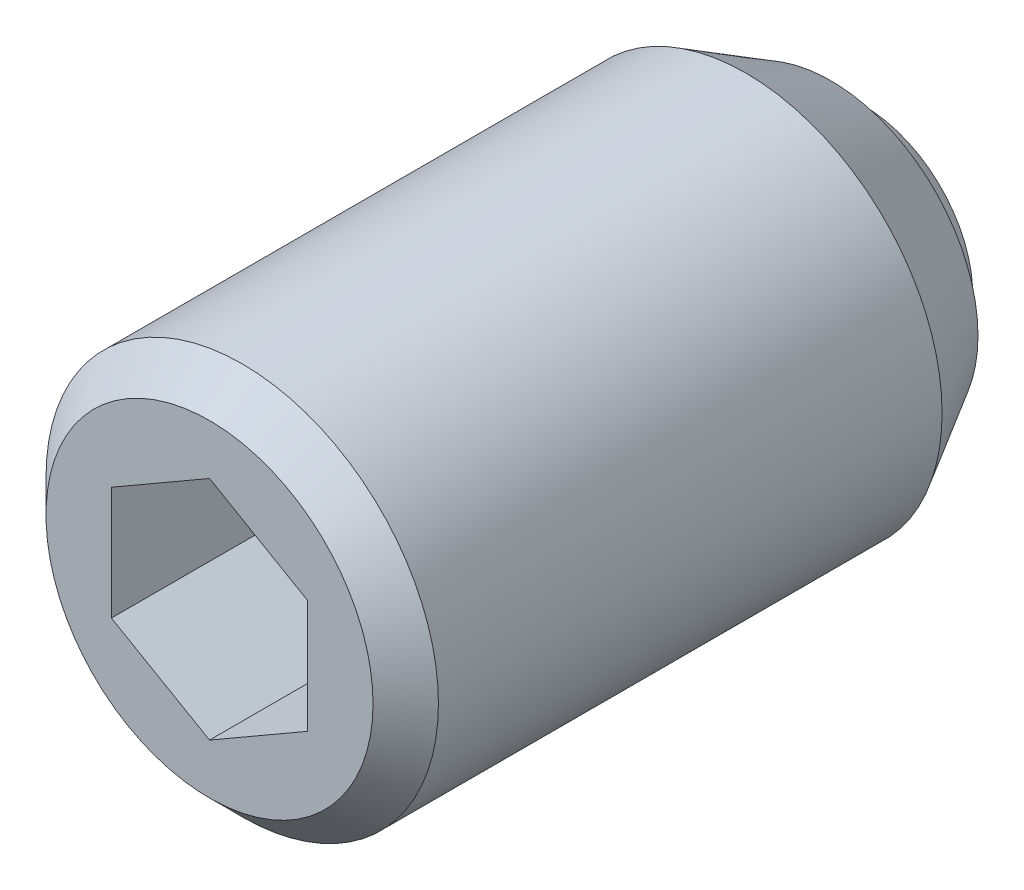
ISO-10303-21;
HEADER;
FILE_DESCRIPTION(('STEP AP214'),'2;1');
FILE_NAME('part.step','',(''),(''),'','','');
FILE_SCHEMA(('AUTOMOTIVE_DESIGN { 1 0 10303 214 1 1 1 1 }'));
ENDSEC;
DATA;
#1=APPLICATION_CONTEXT('core data for automotive mechanical design processes');
#2=APPLICATION_PROTOCOL_DEFINITION('international standard','automotive_design',2000,#1);
#3=PRODUCT_CONTEXT('',#1,'mechanical');
#4=PRODUCT('Part','Part','',(#3));
#5=PRODUCT_RELATED_PRODUCT_CATEGORY('part','',(#4));
#6=PRODUCT_DEFINITION_FORMATION('','',#4);
#7=PRODUCT_DEFINITION_CONTEXT('part definition',#1,'design');
#8=PRODUCT_DEFINITION('design','',#6,#7);
#9=PRODUCT_DEFINITION_SHAPE('','',#8);
#10=(LENGTH_UNIT() NAMED_UNIT(*) SI_UNIT(.MILLI.,.METRE.));
#11=(NAMED_UNIT(*) PLANE_ANGLE_UNIT() SI_UNIT($,.RADIAN.));
#12=(NAMED_UNIT(*) SI_UNIT($,.STERADIAN.) SOLID_ANGLE_UNIT());
#13=UNCERTAINTY_MEASURE_WITH_UNIT(LENGTH_MEASURE(1.E-05),#10,'distance_accuracy_value','');
#14=(GEOMETRIC_REPRESENTATION_CONTEXT(3) GLOBAL_UNCERTAINTY_ASSIGNED_CONTEXT((#13)) GLOBAL_UNIT_ASSIGNED_CONTEXT((#10,
#11,#12)) REPRESENTATION_CONTEXT('',''));
#15=CARTESIAN_POINT('',(0.,0.,0.));
#16=DIRECTION('',(0.,0.,1.));
#17=DIRECTION('',(1.,0.,0.));
#18=AXIS2_PLACEMENT_3D('',#15,#16,#17);
#19=CARTESIAN_POINT('',(1.5,0.866025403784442,7.5));
#20=DIRECTION('',(0.5,0.86602540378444,0.));
#21=DIRECTION('',(0.86602540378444,-0.5,0.));
#22=AXIS2_PLACEMENT_3D('',#19,#20,#21);
#23=PLANE('',#22);
#24=DIRECTION('',(0.,0.,1.));
#25=VECTOR('',#24,1.);
#26=CARTESIAN_POINT('',(1.5,0.866025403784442,7.5));
#27=LINE('',#26,#25);
#28=CARTESIAN_POINT('',(1.5,0.866025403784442,7.));
#29=VERTEX_POINT('',#28);
#30=CARTESIAN_POINT('',(1.5,0.866025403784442,10.));
#31=VERTEX_POINT('',#30);
#32=EDGE_CURVE('E68',#29,#31,#27,.T.);
#33=ORIENTED_EDGE('',*,*,#32,.T.);
#34=DIRECTION('',(-0.86602540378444,0.5,0.));
#35=VECTOR('',#34,1.);
#36=CARTESIAN_POINT('',(1.5,0.866025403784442,10.));
#37=LINE('',#36,#35);
#38=CARTESIAN_POINT('',(0.,1.73205080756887,10.));
#39=VERTEX_POINT('',#38);
#40=EDGE_CURVE('E29',#31,#39,#37,.T.);
#41=ORIENTED_EDGE('',*,*,#40,.T.);
#42=DIRECTION('',(0.,0.,1.));
#43=VECTOR('',#42,1.);
#44=CARTESIAN_POINT('',(0.,1.73205080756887,7.5));
#45=LINE('',#44,#43);
#46=CARTESIAN_POINT('',(0.,1.73205080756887,7.));
#47=VERTEX_POINT('',#46);
#48=EDGE_CURVE('E80',#47,#39,#45,.T.);
#49=ORIENTED_EDGE('',*,*,#48,.F.);
#50=DIRECTION('',(-0.86602540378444,0.5,0.));
#51=VECTOR('',#50,1.);
#52=CARTESIAN_POINT('',(1.5,0.866025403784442,7.));
#53=LINE('',#52,#51);
#54=EDGE_CURVE('E79',#29,#47,#53,.T.);
#55=ORIENTED_EDGE('',*,*,#54,.F.);
#56=EDGE_LOOP('',(#33,#41,#49,#55));
#57=FACE_BOUND('',#56,.T.);
#58=ADVANCED_FACE('F14',(#57),#23,.F.);
#59=CARTESIAN_POINT('',(1.5,-0.866025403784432,7.5));
#60=DIRECTION('',(1.,0.,0.));
#61=DIRECTION('',(0.,-1.,0.));
#62=AXIS2_PLACEMENT_3D('',#59,#60,#61);
#63=PLANE('',#62);
#64=DIRECTION('',(0.,0.,1.));
#65=VECTOR('',#64,1.);
#66=CARTESIAN_POINT('',(1.5,-0.866025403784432,7.5));
#67=LINE('',#66,#65);
#68=CARTESIAN_POINT('',(1.5,-0.866025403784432,7.));
#69=VERTEX_POINT('',#68);
#70=CARTESIAN_POINT('',(1.5,-0.866025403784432,10.));
#71=VERTEX_POINT('',#70);
#72=EDGE_CURVE('E76',#69,#71,#67,.T.);
#73=ORIENTED_EDGE('',*,*,#72,.T.);
#74=DIRECTION('',(0.,1.,0.));
#75=VECTOR('',#74,1.);
#76=CARTESIAN_POINT('',(1.5,-0.866025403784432,10.));
#77=LINE('',#76,#75);
#78=EDGE_CURVE('E75',#71,#31,#77,.T.);
#79=ORIENTED_EDGE('',*,*,#78,.T.);
#80=ORIENTED_EDGE('',*,*,#32,.F.);
#81=DIRECTION('',(0.,1.,0.));
#82=VECTOR('',#81,1.);
#83=CARTESIAN_POINT('',(1.5,-0.866025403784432,7.));
#84=LINE('',#83,#82);
#85=EDGE_CURVE('E72',#69,#29,#84,.T.);
#86=ORIENTED_EDGE('',*,*,#85,.F.);
#87=EDGE_LOOP('',(#73,#79,#80,#86));
#88=FACE_BOUND('',#87,.T.);
#89=ADVANCED_FACE('F70',(#88),#63,.F.);
#90=CARTESIAN_POINT('',(1.5,-0.866025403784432,7.5));
#91=DIRECTION('',(-0.5,0.866025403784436,0.));
#92=DIRECTION('',(0.866025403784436,0.5,0.));
#93=AXIS2_PLACEMENT_3D('',#90,#91,#92);
#94=PLANE('',#93);
#95=DIRECTION('',(0.,0.,1.));
#96=VECTOR('',#95,1.);
#97=CARTESIAN_POINT('',(0.,-1.73205080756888,7.5));
#98=LINE('',#97,#96);
#99=CARTESIAN_POINT('',(0.,-1.73205080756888,7.));
#100=VERTEX_POINT('',#99);
#101=CARTESIAN_POINT('',(0.,-1.73205080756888,10.));
#102=VERTEX_POINT('',#101);
#103=EDGE_CURVE('E122',#100,#102,#98,.T.);
#104=ORIENTED_EDGE('',*,*,#103,.T.);
#105=DIRECTION('',(-0.866025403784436,-0.5,0.));
#106=VECTOR('',#105,1.);
#107=CARTESIAN_POINT('',(1.5,-0.866025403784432,10.));
#108=LINE('',#107,#106);
#109=EDGE_CURVE('E113',#71,#102,#108,.T.);
#110=ORIENTED_EDGE('',*,*,#109,.F.);
#111=ORIENTED_EDGE('',*,*,#72,.F.);
#112=DIRECTION('',(0.866025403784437,0.5,0.));
#113=VECTOR('',#112,1.);
#114=CARTESIAN_POINT('',(0.,-1.73205080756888,7.));
#115=LINE('',#114,#113);
#116=EDGE_CURVE('E89',#100,#69,#115,.T.);
#117=ORIENTED_EDGE('',*,*,#116,.F.);
#118=EDGE_LOOP('',(#104,#110,#111,#117));
#119=FACE_BOUND('',#118,.T.);
#120=ADVANCED_FACE('F147',(#119),#94,.T.);
#121=CARTESIAN_POINT('',(-1.5,-0.866025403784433,7.5));
#122=DIRECTION('',(-0.5,-0.866025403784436,0.));
#123=DIRECTION('',(-0.866025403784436,0.5,0.));
#124=AXIS2_PLACEMENT_3D('',#121,#122,#123);
#125=PLANE('',#124);
#126=DIRECTION('',(0.,0.,1.));
#127=VECTOR('',#126,1.);
#128=CARTESIAN_POINT('',(-1.5,-0.866025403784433,7.5));
#129=LINE('',#128,#127);
#130=CARTESIAN_POINT('',(-1.5,-0.866025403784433,7.));
#131=VERTEX_POINT('',#130);
#132=CARTESIAN_POINT('',(-1.5,-0.866025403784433,10.));
#133=VERTEX_POINT('',#132);
#134=EDGE_CURVE('E120',#131,#133,#129,.T.);
#135=ORIENTED_EDGE('',*,*,#134,.T.);
#136=DIRECTION('',(0.866025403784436,-0.5,0.));
#137=VECTOR('',#136,1.);
#138=CARTESIAN_POINT('',(-1.5,-0.866025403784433,10.));
#139=LINE('',#138,#137);
#140=EDGE_CURVE('E111',#133,#102,#139,.T.);
#141=ORIENTED_EDGE('',*,*,#140,.T.);
#142=ORIENTED_EDGE('',*,*,#103,.F.);
#143=DIRECTION('',(0.866025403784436,-0.5,0.));
#144=VECTOR('',#143,1.);
#145=CARTESIAN_POINT('',(-1.5,-0.866025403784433,7.));
#146=LINE('',#145,#144);
#147=EDGE_CURVE('E101',#131,#100,#146,.T.);
#148=ORIENTED_EDGE('',*,*,#147,.F.);
#149=EDGE_LOOP('',(#135,#141,#142,#148));
#150=FACE_BOUND('',#149,.T.);
#151=ADVANCED_FACE('F157',(#150),#125,.F.);
#152=CARTESIAN_POINT('',(-1.5,-0.866025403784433,7.5));
#153=DIRECTION('',(1.,0.,0.));
#154=DIRECTION('',(0.,-1.,0.));
#155=AXIS2_PLACEMENT_3D('',#152,#153,#154);
#156=PLANE('',#155);
#157=DIRECTION('',(0.,0.,1.));
#158=VECTOR('',#157,1.);
#159=CARTESIAN_POINT('',(-1.5,0.866025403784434,7.5));
#160=LINE('',#159,#158);
#161=CARTESIAN_POINT('',(-1.5,0.866025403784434,7.));
#162=VERTEX_POINT('',#161);
#163=CARTESIAN_POINT('',(-1.5,0.866025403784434,10.));
#164=VERTEX_POINT('',#163);
#165=EDGE_CURVE('E37',#162,#164,#160,.T.);
#166=ORIENTED_EDGE('',*,*,#165,.T.);
#167=DIRECTION('',(0.,1.,0.));
#168=VECTOR('',#167,1.);
#169=CARTESIAN_POINT('',(-1.5,-0.866025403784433,10.));
#170=LINE('',#169,#168);
#171=EDGE_CURVE('E108',#133,#164,#170,.T.);
#172=ORIENTED_EDGE('',*,*,#171,.F.);
#173=ORIENTED_EDGE('',*,*,#134,.F.);
#174=DIRECTION('',(0.,-1.,0.));
#175=VECTOR('',#174,1.);
#176=CARTESIAN_POINT('',(-1.5,0.866025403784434,7.));
#177=LINE('',#176,#175);
#178=EDGE_CURVE('E98',#162,#131,#177,.T.);
#179=ORIENTED_EDGE('',*,*,#178,.F.);
#180=EDGE_LOOP('',(#166,#172,#173,#179));
#181=FACE_BOUND('',#180,.T.);
#182=ADVANCED_FACE('F153',(#181),#156,.T.);
#183=CARTESIAN_POINT('',(-1.5,0.866025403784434,7.5));
#184=DIRECTION('',(0.5,-0.866025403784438,0.));
#185=DIRECTION('',(-0.866025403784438,-0.5,0.));
#186=AXIS2_PLACEMENT_3D('',#183,#184,#185);
#187=PLANE('',#186);
#188=ORIENTED_EDGE('',*,*,#165,.F.);
#189=DIRECTION('',(-0.866025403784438,-0.5,0.));
#190=VECTOR('',#189,1.);
#191=CARTESIAN_POINT('',(0.,1.73205080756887,7.));
#192=LINE('',#191,#190);
#193=EDGE_CURVE('E84',#47,#162,#192,.T.);
#194=ORIENTED_EDGE('',*,*,#193,.F.);
#195=ORIENTED_EDGE('',*,*,#48,.T.);
#196=DIRECTION('',(0.866025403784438,0.5,0.));
#197=VECTOR('',#196,1.);
#198=CARTESIAN_POINT('',(-1.5,0.866025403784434,10.));
#199=LINE('',#198,#197);
#200=EDGE_CURVE('E105',#164,#39,#199,.T.);
#201=ORIENTED_EDGE('',*,*,#200,.F.);
#202=EDGE_LOOP('',(#188,#194,#195,#201));
#203=FACE_BOUND('',#202,.T.);
#204=ADVANCED_FACE('F150',(#203),#187,.T.);
#205=CARTESIAN_POINT('',(0.,0.,9.75));
#206=DIRECTION('',(0.,0.,-1.));
#207=DIRECTION('',(1.,0.,0.));
#208=AXIS2_PLACEMENT_3D('',#205,#206,#207);
#209=CYLINDRICAL_SURFACE('',#208,3.);
#210=CARTESIAN_POINT('',(0.,0.,9.5));
#211=DIRECTION('',(0.,0.,-1.));
#212=DIRECTION('',(1.,0.,0.));
#213=AXIS2_PLACEMENT_3D('',#210,#211,#212);
#214=CIRCLE('',#213,3.);
#215=CARTESIAN_POINT('',(3.,0.,9.5));
#216=VERTEX_POINT('',#215);
#217=EDGE_CURVE('E9',#216,#216,#214,.T.);
#218=ORIENTED_EDGE('',*,*,#217,.T.);
#219=EDGE_LOOP('',(#218));
#220=FACE_BOUND('',#219,.T.);
#221=CARTESIAN_POINT('',(0.,0.,1.79903810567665));
#222=DIRECTION('',(0.,0.,-1.));
#223=DIRECTION('',(-1.,0.,0.));
#224=AXIS2_PLACEMENT_3D('',#221,#222,#223);
#225=CIRCLE('',#224,3.);
#226=CARTESIAN_POINT('',(-3.,0.,1.79903810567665));
#227=VERTEX_POINT('',#226);
#228=EDGE_CURVE('E260',#227,#227,#225,.T.);
#229=ORIENTED_EDGE('',*,*,#228,.F.);
#230=EDGE_LOOP('',(#229));
#231=FACE_BOUND('',#230,.T.);
#232=ADVANCED_FACE('F16',(#220,#231),#209,.T.);
#233=CARTESIAN_POINT('',(0.,0.,9.5));
#234=DIRECTION('',(0.,0.,-1.));
#235=DIRECTION('',(1.,0.,0.));
#236=AXIS2_PLACEMENT_3D('',#233,#234,#235);
#237=CONICAL_SURFACE('',#236,3.,0.785398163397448);
#238=CARTESIAN_POINT('',(0.,0.,10.));
#239=DIRECTION('',(0.,0.,-1.));
#240=DIRECTION('',(1.,0.,0.));
#241=AXIS2_PLACEMENT_3D('',#238,#239,#240);
#242=CIRCLE('',#241,2.5);
#243=CARTESIAN_POINT('',(2.5,0.,10.));
#244=VERTEX_POINT('',#243);
#245=EDGE_CURVE('E22',#244,#244,#242,.T.);
#246=ORIENTED_EDGE('',*,*,#245,.T.);
#247=EDGE_LOOP('',(#246));
#248=FACE_BOUND('',#247,.T.);
#249=ORIENTED_EDGE('',*,*,#217,.F.);
#250=EDGE_LOOP('',(#249));
#251=FACE_BOUND('',#250,.T.);
#252=ADVANCED_FACE('F127',(#248,#251),#237,.T.);
#253=CARTESIAN_POINT('',(0.,0.,10.));
#254=DIRECTION('',(0.,0.,-1.));
#255=DIRECTION('',(1.,0.,0.));
#256=AXIS2_PLACEMENT_3D('',#253,#254,#255);
#257=PLANE('',#256);
#258=ORIENTED_EDGE('',*,*,#200,.T.);
#259=ORIENTED_EDGE('',*,*,#40,.F.);
#260=ORIENTED_EDGE('',*,*,#78,.F.);
#261=ORIENTED_EDGE('',*,*,#109,.T.);
#262=ORIENTED_EDGE('',*,*,#140,.F.);
#263=ORIENTED_EDGE('',*,*,#171,.T.);
#264=EDGE_LOOP('',(#258,#259,#260,#261,#262,#263));
#265=FACE_BOUND('',#264,.T.);
#266=ORIENTED_EDGE('',*,*,#245,.F.);
#267=EDGE_LOOP('',(#266));
#268=FACE_BOUND('',#267,.T.);
#269=ADVANCED_FACE('F130',(#265,#268),#257,.F.);
#270=CARTESIAN_POINT('',(1.5,0.866025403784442,7.));
#271=DIRECTION('',(0.,0.,1.));
#272=DIRECTION('',(1.,0.,0.));
#273=AXIS2_PLACEMENT_3D('',#270,#271,#272);
#274=PLANE('',#273);
#275=ORIENTED_EDGE('',*,*,#85,.T.);
#276=ORIENTED_EDGE('',*,*,#54,.T.);
#277=ORIENTED_EDGE('',*,*,#193,.T.);
#278=ORIENTED_EDGE('',*,*,#178,.T.);
#279=ORIENTED_EDGE('',*,*,#147,.T.);
#280=ORIENTED_EDGE('',*,*,#116,.T.);
#281=EDGE_LOOP('',(#275,#276,#277,#278,#279,#280));
#282=FACE_BOUND('',#281,.T.);
#283=ADVANCED_FACE('F86',(#282),#274,.T.);
#284=CARTESIAN_POINT('',(0.,0.,0.));
#285=DIRECTION('',(0.,0.,-1.));
#286=DIRECTION('',(-1.,0.,0.));
#287=AXIS2_PLACEMENT_3D('',#284,#285,#286);
#288=PLANE('',#287);
#289=CARTESIAN_POINT('',(0.,0.,0.));
#290=DIRECTION('',(0.,0.,-1.));
#291=DIRECTION('',(-1.,0.,0.));
#292=AXIS2_PLACEMENT_3D('',#289,#290,#291);
#293=CIRCLE('',#292,1.670329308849);
#294=CARTESIAN_POINT('',(-1.67032930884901,0.,0.));
#295=VERTEX_POINT('',#294);
#296=EDGE_CURVE('E90',#295,#295,#293,.T.);
#297=ORIENTED_EDGE('',*,*,#296,.T.);
#298=EDGE_LOOP('',(#297));
#299=FACE_BOUND('',#298,.T.);
#300=ADVANCED_FACE('F139',(#299),#288,.T.);
#301=CARTESIAN_POINT('',(0.,0.,1.1));
#302=DIRECTION('',(0.,0.,-1.));
#303=DIRECTION('',(-1.,0.,0.));
#304=AXIS2_PLACEMENT_3D('',#301,#302,#303);
#305=SPHERICAL_SURFACE('',#304,2.);
#306=CARTESIAN_POINT('',(0.,0.,0.5));
#307=DIRECTION('',(0.,0.,-1.));
#308=DIRECTION('',(-1.,0.,0.));
#309=AXIS2_PLACEMENT_3D('',#306,#307,#308);
#310=CIRCLE('',#309,1.90787840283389);
#311=CARTESIAN_POINT('',(-1.90787840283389,0.,0.5));
#312=VERTEX_POINT('',#311);
#313=EDGE_CURVE('E93',#312,#312,#310,.T.);
#314=CARTESIAN_POINT('',(-1.90787840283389,0.,0.5));
#315=CARTESIAN_POINT('',(-1.90614295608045,0.,0.494481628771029));
#316=CARTESIAN_POINT('',(-1.90438356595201,0.,0.488970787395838));
#317=CARTESIAN_POINT('',(-1.90081703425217,0.,0.477964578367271));
#318=CARTESIAN_POINT('',(-1.89900989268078,0.,0.472469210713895));
#319=CARTESIAN_POINT('',(-1.8953479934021,0.,0.46149436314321));
#320=CARTESIAN_POINT('',(-1.89349323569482,0.,0.456014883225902));
#321=CARTESIAN_POINT('',(-1.88973624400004,0.,0.445072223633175));
#322=CARTESIAN_POINT('',(-1.88783401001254,0.,0.439609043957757));
#323=CARTESIAN_POINT('',(-1.8839822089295,0.,0.428699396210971));
#324=CARTESIAN_POINT('',(-1.88203264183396,0.,0.423252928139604));
#325=CARTESIAN_POINT('',(-1.87808632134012,0.,0.412377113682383));
#326=CARTESIAN_POINT('',(-1.87608956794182,0.,0.40694776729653));
#327=CARTESIAN_POINT('',(-1.87204902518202,0.,0.396106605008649));
#328=CARTESIAN_POINT('',(-1.87000523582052,0.,0.39069478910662));
#329=CARTESIAN_POINT('',(-1.86587077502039,0.,0.379889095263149));
#330=CARTESIAN_POINT('',(-1.86378010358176,0.,0.374495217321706));
#331=CARTESIAN_POINT('',(-1.85955203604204,0.,0.363725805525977));
#332=CARTESIAN_POINT('',(-1.85741463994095,0.,0.358350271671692));
#333=CARTESIAN_POINT('',(-1.85309328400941,0.,0.347617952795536));
#334=CARTESIAN_POINT('',(-1.85090932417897,0.,0.342261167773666));
#335=CARTESIAN_POINT('',(-1.84649500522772,0.,0.331566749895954));
#336=CARTESIAN_POINT('',(-1.84426464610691,0.,0.326229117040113));
#337=CARTESIAN_POINT('',(-1.83975769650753,0.,0.315573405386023));
#338=CARTESIAN_POINT('',(-1.83748110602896,0.,0.310255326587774));
#339=CARTESIAN_POINT('',(-1.83288186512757,0.,0.299639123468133));
#340=CARTESIAN_POINT('',(-1.83055921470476,0.,0.29434099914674));
#341=CARTESIAN_POINT('',(-1.82586802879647,0.,0.283765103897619));
#342=CARTESIAN_POINT('',(-1.823499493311,0.,0.278487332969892));
#343=CARTESIAN_POINT('',(-1.81871671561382,0.,0.267952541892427));
#344=CARTESIAN_POINT('',(-1.81630247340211,0.,0.26269552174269));
#345=CARTESIAN_POINT('',(-1.81142846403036,0.,0.252202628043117));
#346=CARTESIAN_POINT('',(-1.80896869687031,0.,0.246966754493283));
#347=CARTESIAN_POINT('',(-1.80400382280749,0.,0.236516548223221));
#348=CARTESIAN_POINT('',(-1.80149871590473,0.,0.231302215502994));
#349=CARTESIAN_POINT('',(-1.79644335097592,0.,0.220895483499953));
#350=CARTESIAN_POINT('',(-1.79389309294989,0.,0.215703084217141));
#351=CARTESIAN_POINT('',(-1.78874761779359,0.,0.205340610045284));
#352=CARTESIAN_POINT('',(-1.78615240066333,0.,0.200170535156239));
#353=CARTESIAN_POINT('',(-1.78091720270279,0.,0.189853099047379));
#354=CARTESIAN_POINT('',(-1.77827722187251,0.,0.184705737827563));
#355=CARTESIAN_POINT('',(-1.77295269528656,0.,0.174434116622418));
#356=CARTESIAN_POINT('',(-1.77026814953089,0.,0.169309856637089));
#357=CARTESIAN_POINT('',(-1.76485469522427,0.,0.159084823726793));
#358=CARTESIAN_POINT('',(-1.76212578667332,0.,0.153984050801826));
#359=CARTESIAN_POINT('',(-1.7566238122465,0.,0.143806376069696));
#360=CARTESIAN_POINT('',(-1.75385074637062,0.,0.138729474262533));
#361=CARTESIAN_POINT('',(-1.7482606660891,0.,0.128599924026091));
#362=CARTESIAN_POINT('',(-1.74544365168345,0.,0.123547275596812));
#363=CARTESIAN_POINT('',(-1.73976588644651,0.,0.113466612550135));
#364=CARTESIAN_POINT('',(-1.73690513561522,0.,0.108438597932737));
#365=CARTESIAN_POINT('',(-1.73114011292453,0.,0.0984075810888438));
#366=CARTESIAN_POINT('',(-1.72823584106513,0.,0.0934045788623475));
#367=CARTESIAN_POINT('',(-1.72238399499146,0.,0.0834239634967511));
#368=CARTESIAN_POINT('',(-1.71943642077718,0.,0.078446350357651));
#369=CARTESIAN_POINT('',(-1.71349819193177,0.,0.0685168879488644));
#370=CARTESIAN_POINT('',(-1.71050753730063,0.,0.0635650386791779));
#371=CARTESIAN_POINT('',(-1.70448337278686,0.,0.0536874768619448));
#372=CARTESIAN_POINT('',(-1.70144986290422,0.,0.0487617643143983));
#373=CARTESIAN_POINT('',(-1.6953402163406,0.,0.0389368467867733));
#374=CARTESIAN_POINT('',(-1.69226407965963,0.,0.034037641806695));
#375=CARTESIAN_POINT('',(-1.68606941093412,0.,0.0242661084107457));
#376=CARTESIAN_POINT('',(-1.68295087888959,0.,0.0193937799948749));
#377=CARTESIAN_POINT('',(-1.67667165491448,0.,0.00967636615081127));
#378=CARTESIAN_POINT('',(-1.67351096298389,0.,0.00483128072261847));
#379=CARTESIAN_POINT('',(-1.67032930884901,0.,0.));
#380=B_SPLINE_CURVE_WITH_KNOTS('',3,(#314,#315,#316,#317,#318,#319,#320,#321,#322,#323,#324,
#325,#326,#327,#328,#329,#330,#331,#332,#333,#334,#335,#336,#337,#338,#339,#340,#341,#342,#343,
#344,#345,#346,#347,#348,#349,#350,#351,#352,#353,#354,#355,#356,#357,#358,#359,#360,#361,#362,
#363,#364,#365,#366,#367,#368,#369,#370,#371,#372,#373,#374,#375,#376,#377,#378,#379),
.UNSPECIFIED.,.F.,.F.,(4,2,2,2,2,2,2,2,2,2,2,2,2,2,2,2,2,2,2,2,2,2,2,2,2,2,2,2,2,2,2,2,4),(0.,
0.0173544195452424,0.0347088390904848,0.0520632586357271,0.0694176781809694,0.0867720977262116,
0.104126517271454,0.121480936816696,0.138835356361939,0.156189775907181,0.173544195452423,
0.190898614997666,0.208253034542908,0.22560745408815,0.242961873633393,0.260316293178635,
0.277670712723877,0.295025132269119,0.312379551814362,0.329733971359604,0.347088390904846,
0.364442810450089,0.381797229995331,0.399151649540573,0.416506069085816,0.433860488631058,
0.4512149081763,0.468569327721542,0.485923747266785,0.503278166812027,0.52063258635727,
0.537987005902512,0.555341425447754),.UNSPECIFIED.);
#381=EDGE_CURVE('BSEAM223',#312,#295,#380,.T.);
#382=ORIENTED_EDGE('',*,*,#313,.T.);
#383=ORIENTED_EDGE('',*,*,#296,.F.);
#384=ORIENTED_EDGE('',*,*,#381,.T.);
#385=ORIENTED_EDGE('',*,*,#381,.F.);
#386=EDGE_LOOP('',(#382,#384,#383,#385));
#387=FACE_BOUND('',#386,.T.);
#388=ADVANCED_FACE('F223',(#387),#305,.T.);
#389=CARTESIAN_POINT('',(-1.90787840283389,0.,0.5));
#390=DIRECTION('',(0.,0.,-1.));
#391=DIRECTION('',(-1.,0.,0.));
#392=AXIS2_PLACEMENT_3D('',#389,#390,#391);
#393=PLANE('',#392);
#394=CARTESIAN_POINT('',(0.,0.,0.5));
#395=DIRECTION('',(0.,0.,-1.));
#396=DIRECTION('',(-1.,0.,0.));
#397=AXIS2_PLACEMENT_3D('',#394,#395,#396);
#398=CIRCLE('',#397,2.25);
#399=CARTESIAN_POINT('',(-2.25,0.,0.5));
#400=VERTEX_POINT('',#399);
#401=EDGE_CURVE('E263',#400,#400,#398,.T.);
#402=ORIENTED_EDGE('',*,*,#401,.T.);
#403=EDGE_LOOP('',(#402));
#404=FACE_BOUND('',#403,.T.);
#405=ORIENTED_EDGE('',*,*,#313,.F.);
#406=EDGE_LOOP('',(#405));
#407=FACE_BOUND('',#406,.T.);
#408=ADVANCED_FACE('F232',(#404,#407),#393,.T.);
#409=CARTESIAN_POINT('',(0.,0.,0.5));
#410=DIRECTION('',(0.,0.,1.));
#411=DIRECTION('',(1.,0.,0.));
#412=AXIS2_PLACEMENT_3D('',#409,#410,#411);
#413=CONICAL_SURFACE('',#412,2.25,0.523598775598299);
#414=ORIENTED_EDGE('',*,*,#228,.T.);
#415=EDGE_LOOP('',(#414));
#416=FACE_BOUND('',#415,.T.);
#417=ORIENTED_EDGE('',*,*,#401,.F.);
#418=EDGE_LOOP('',(#417));
#419=FACE_BOUND('',#418,.T.);
#420=ADVANCED_FACE('F242',(#416,#419),#413,.T.);
#421=CLOSED_SHELL('',(#58,#89,#120,#151,#182,#204,#232,#252,#269,#283,#300,#388,#408,#420));
#422=MANIFOLD_SOLID_BREP('B1',#421);
#423=ADVANCED_BREP_SHAPE_REPRESENTATION('',(#18,#422),#14);
#424=SHAPE_DEFINITION_REPRESENTATION(#9,#423);
ENDSEC;
END-ISO-10303-21;
